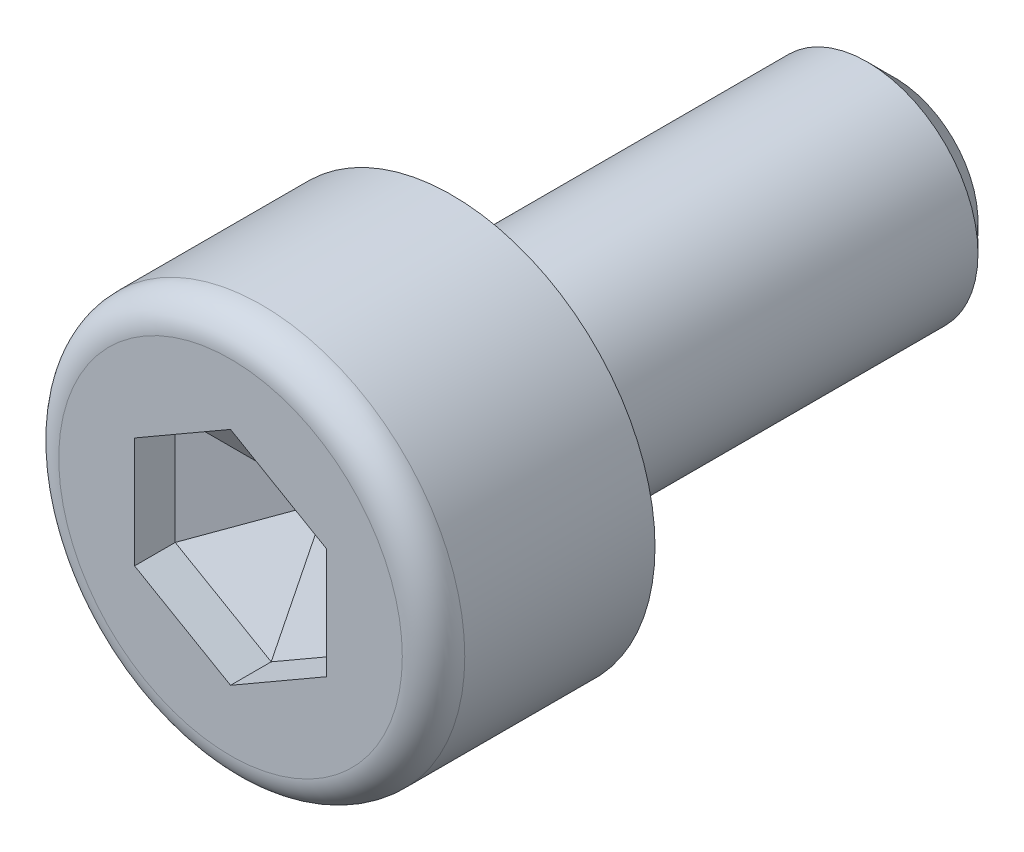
from build123d import *
from OCP.BRepFilletAPI import BRepFilletAPI_MakeChamfer

# Parameters (mm, degrees)
SKETCH_1_R          = 2.75
EXTRUDE_1_DEPTH     = 3
CUT_EXTRUDE_1_DEPTH = 1.3
SKETCH_3_R          = 1.5
EXTRUDE_2_DEPTH     = 6
CHAMFER_1_SIZE      = 0.375
FILLET_1_R          = 0.423076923
CHAMFER_2_SIZE      = 0.749279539
CHAMFER_2_SIZE2     = 1.29779023
FILLET_2_R          = 0.1


with BuildPart() as part:
    # Sketch 1 → Extrude 1 (new body)
    with BuildSketch(Plane.XY):
        Circle(SKETCH_1_R)
    extrude(amount=EXTRUDE_1_DEPTH)

    # Sketch 2 → Cut-Extrude 1 (cut)
    with BuildSketch(Plane.XY.offset(3)):
        Polygon((1.3, 0.75055535), (0, 1.5011107), (-1.3, 0.75055535), (-1.3, -0.75055535), (0, -1.5011107), (1.3, -0.75055535), align=None)
    extrude(amount=-CUT_EXTRUDE_1_DEPTH, mode=Mode.SUBTRACT)

    # Sketch 3 → Extrude 2 (add)
    with BuildSketch(Plane(origin=(0, 0, 0), x_dir=(-1, 0, 0), z_dir=(0, 0, -1))):
        with Locations(Location((0, 0, 0), (0, 0, 180))):
            Circle(SKETCH_3_R)
    extrude(amount=EXTRUDE_2_DEPTH)

    # Chamfer 1
    chamfer_1_edges = [part.edges().sort_by_distance(p)[0] for p in [
        (-1.5, 0, -6),
    ]]
    chamfer(chamfer_1_edges, length=CHAMFER_1_SIZE)

    # Fillet 1
    fillet_1_edges = [part.edges().sort_by_distance(p)[0] for p in [
        (-2.75, 0, 3),
    ]]
    fillet(fillet_1_edges, radius=FILLET_1_R)

    # Chamfer 2: one chamfer whose edges measure the first distance from different faces: ONE call of the kernel's chamfer builder (chamfer() names one face for all edges)
    chamfer_2_edges_1 = [part.edges().sort_by_distance(p)[0] for p in [
        (-0.65, 1.125833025, 1.7),
    ]]
    chamfer_2_side_1 = [part.faces().sort_by_distance(p)[0] for p in [
        (-0.65, 1.125833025, 2.35),
    ]]
    chamfer_2_edges_2 = [part.edges().sort_by_distance(p)[0] for p in [
        (0.65, 1.125833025, 1.7),
    ]]
    chamfer_2_side_2 = [part.faces().sort_by_distance(p)[0] for p in [
        (0.65, 1.125833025, 2.35),
    ]]
    chamfer_2_edges_3 = [part.edges().sort_by_distance(p)[0] for p in [
        (1.3, 0, 1.7),
    ]]
    chamfer_2_side_3 = [part.faces().sort_by_distance(p)[0] for p in [
        (1.3, 0, 2.35),
    ]]
    chamfer_2_edges_4 = [part.edges().sort_by_distance(p)[0] for p in [
        (0.65, -1.125833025, 1.7),
    ]]
    chamfer_2_side_4 = [part.faces().sort_by_distance(p)[0] for p in [
        (0.65, -1.125833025, 2.35),
    ]]
    chamfer_2_edges_5 = [part.edges().sort_by_distance(p)[0] for p in [
        (-0.65, -1.125833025, 1.7),
    ]]
    chamfer_2_side_5 = [part.faces().sort_by_distance(p)[0] for p in [
        (-0.65, -1.125833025, 2.35),
    ]]
    chamfer_2_edges_6 = [part.edges().sort_by_distance(p)[0] for p in [
        (-1.3, 0, 1.7),
    ]]
    chamfer_2_side_6 = [part.faces().sort_by_distance(p)[0] for p in [
        (-1.3, 0, 2.35),
    ]]
    chamfer_2 = BRepFilletAPI_MakeChamfer(part.part.solid().wrapped)
    for e in chamfer_2_edges_1:
        chamfer_2.Add(CHAMFER_2_SIZE, CHAMFER_2_SIZE2, e.wrapped, chamfer_2_side_1[0].wrapped)  # the first distance lies on this face
    for e in chamfer_2_edges_2:
        chamfer_2.Add(CHAMFER_2_SIZE, CHAMFER_2_SIZE2, e.wrapped, chamfer_2_side_2[0].wrapped)  # the first distance lies on this face
    for e in chamfer_2_edges_3:
        chamfer_2.Add(CHAMFER_2_SIZE, CHAMFER_2_SIZE2, e.wrapped, chamfer_2_side_3[0].wrapped)  # the first distance lies on this face
    for e in chamfer_2_edges_4:
        chamfer_2.Add(CHAMFER_2_SIZE, CHAMFER_2_SIZE2, e.wrapped, chamfer_2_side_4[0].wrapped)  # the first distance lies on this face
    for e in chamfer_2_edges_5:
        chamfer_2.Add(CHAMFER_2_SIZE, CHAMFER_2_SIZE2, e.wrapped, chamfer_2_side_5[0].wrapped)  # the first distance lies on this face
    for e in chamfer_2_edges_6:
        chamfer_2.Add(CHAMFER_2_SIZE, CHAMFER_2_SIZE2, e.wrapped, chamfer_2_side_6[0].wrapped)  # the first distance lies on this face
    add(Compound.cast(chamfer_2.Shape()), mode=Mode.REPLACE)

    # Fillet 2
    fillet_2_edges = [part.edges().sort_by_distance(p)[0] for p in [
        (-1.5, 0, 0),
    ]]
    fillet(fillet_2_edges, radius=FILLET_2_R)


solid = part.part
